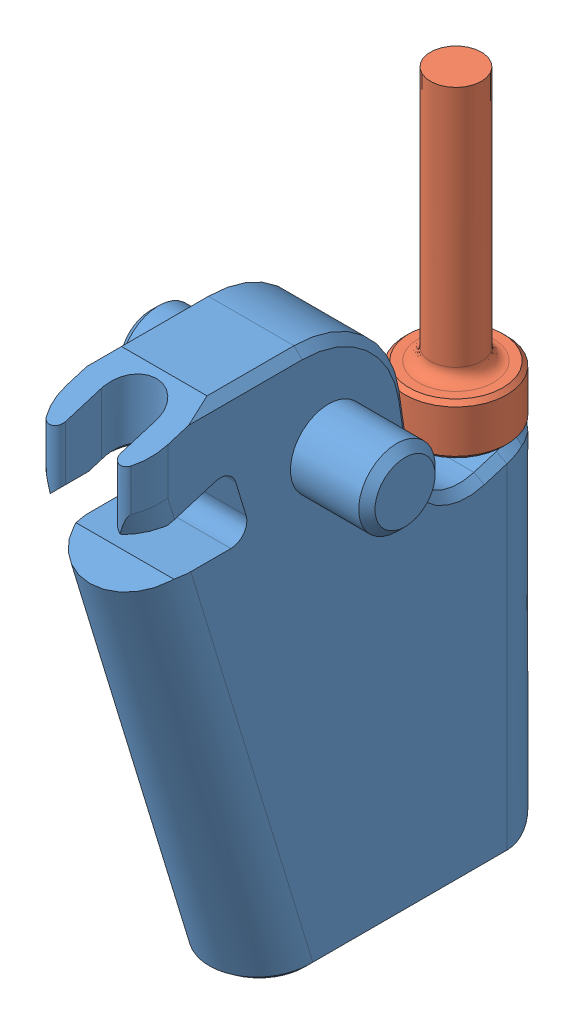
SolidWorks assembly EJA125.SLDASM, configuration Default (file format 13000). Lengths in mm.
Overall size (15.88 41.64 26.3).
2 component instances, 2 part files, 6 mates.
Components (placement in the parent):
- EJA125-1: EJA125.SLDPRT [Default] at origin size (15.88 34.3 26.3)
- KP125L.750-1: KP125L.750.sldprt [Default] at (0 -5.6071 -11.1125) x (-1 0 0) z (0 1 0) size (6.35 6.35 19.05)
Mates (geometry in assembly coordinates):
- Coincident1: coincident anti-aligned: plane of EP125L.75-1 through (0 -5.6071 -11.1125) normal (-1 0 0)
- Distance2: distance = 11.1125 mm aligned: plane of EP125L.75-1 through (0 -5.6071 -11.1125) normal (0 0 1)
- Coincident2: coincident: line of EPA125-1 through (-2.4569 -5.6071 -12.0015) axis (1 0 0); plane of EP125L.75-1 through (0 -5.6071 -11.1125) normal (0 -1 0)
- Coincident3: coincident: axis of EPA125-1 through (7.4295 0 0) axis (-1 0 0)
- Coincident4: coincident aligned: plane of EPA125-1 through (0 0 0) normal (1 0 0)
- Angle1: planar angle: plane of assembly through (0 0 0) normal (0 1 0); plane of EPA125-1 through (0 0 0) normal (0 1 0)
